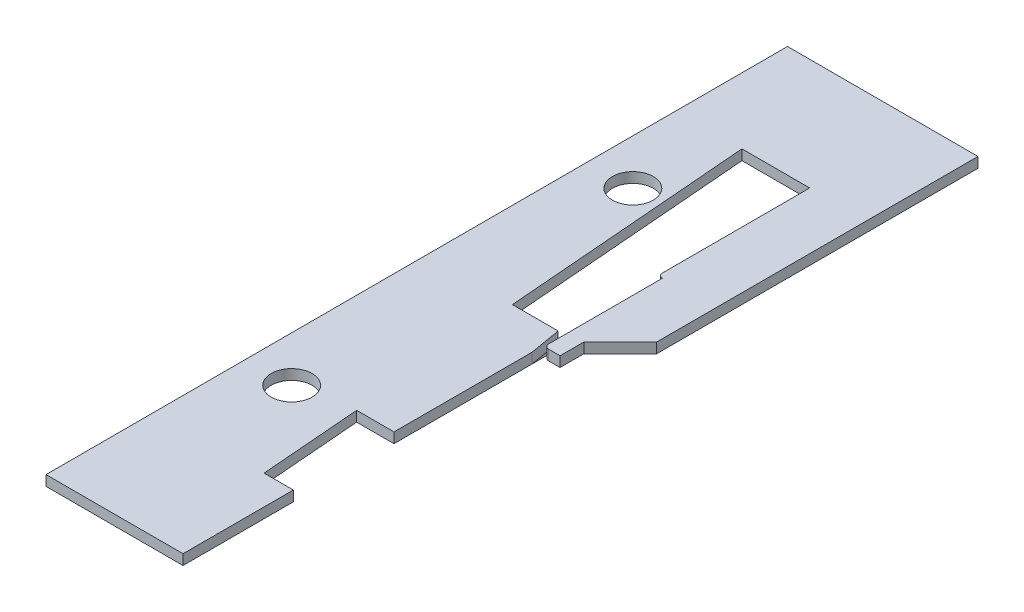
ISO-10303-21;
HEADER;
FILE_DESCRIPTION(('STEP AP214'),'2;1');
FILE_NAME('part.step','',(''),(''),'','','');
FILE_SCHEMA(('AUTOMOTIVE_DESIGN { 1 0 10303 214 1 1 1 1 }'));
ENDSEC;
DATA;
#1=APPLICATION_CONTEXT('core data for automotive mechanical design processes');
#2=APPLICATION_PROTOCOL_DEFINITION('international standard','automotive_design',2000,#1);
#3=PRODUCT_CONTEXT('',#1,'mechanical');
#4=PRODUCT('Part','Part','',(#3));
#5=PRODUCT_RELATED_PRODUCT_CATEGORY('part','',(#4));
#6=PRODUCT_DEFINITION_FORMATION('','',#4);
#7=PRODUCT_DEFINITION_CONTEXT('part definition',#1,'design');
#8=PRODUCT_DEFINITION('design','',#6,#7);
#9=PRODUCT_DEFINITION_SHAPE('','',#8);
#10=(LENGTH_UNIT() NAMED_UNIT(*) SI_UNIT(.MILLI.,.METRE.));
#11=(NAMED_UNIT(*) PLANE_ANGLE_UNIT() SI_UNIT($,.RADIAN.));
#12=(NAMED_UNIT(*) SI_UNIT($,.STERADIAN.) SOLID_ANGLE_UNIT());
#13=UNCERTAINTY_MEASURE_WITH_UNIT(LENGTH_MEASURE(1.E-05),#10,'distance_accuracy_value','');
#14=(GEOMETRIC_REPRESENTATION_CONTEXT(3) GLOBAL_UNCERTAINTY_ASSIGNED_CONTEXT((#13)) GLOBAL_UNIT_ASSIGNED_CONTEXT((#10,
#11,#12)) REPRESENTATION_CONTEXT('',''));
#15=CARTESIAN_POINT('',(0.,0.,0.));
#16=DIRECTION('',(0.,0.,1.));
#17=DIRECTION('',(1.,0.,0.));
#18=AXIS2_PLACEMENT_3D('',#15,#16,#17);
#19=CARTESIAN_POINT('',(42.25,0.9,0.));
#20=DIRECTION('',(1.,0.,0.));
#21=DIRECTION('',(0.,0.,-1.));
#22=AXIS2_PLACEMENT_3D('',#19,#20,#21);
#23=PLANE('',#22);
#24=DIRECTION('',(0.,-1.,0.));
#25=VECTOR('',#24,1.);
#26=CARTESIAN_POINT('',(42.25,0.9,-9.5));
#27=LINE('',#26,#25);
#28=CARTESIAN_POINT('',(42.25,0.9,-9.5));
#29=VERTEX_POINT('',#28);
#30=CARTESIAN_POINT('',(42.25,0.,-9.5));
#31=VERTEX_POINT('',#30);
#32=EDGE_CURVE('E300',#29,#31,#27,.T.);
#33=ORIENTED_EDGE('',*,*,#32,.T.);
#34=DIRECTION('',(0.,0.,1.));
#35=VECTOR('',#34,1.);
#36=CARTESIAN_POINT('',(42.25,0.,-13.5000000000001));
#37=LINE('',#36,#35);
#38=CARTESIAN_POINT('',(42.25,0.,-13.5000000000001));
#39=VERTEX_POINT('',#38);
#40=EDGE_CURVE('E277',#39,#31,#37,.T.);
#41=ORIENTED_EDGE('',*,*,#40,.F.);
#42=DIRECTION('',(0.,1.,0.));
#43=VECTOR('',#42,1.);
#44=CARTESIAN_POINT('',(42.25,-0.4,-13.5000000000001));
#45=LINE('',#44,#43);
#46=CARTESIAN_POINT('',(42.25,-0.4,-13.5000000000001));
#47=VERTEX_POINT('',#46);
#48=EDGE_CURVE('E285',#47,#39,#45,.T.);
#49=ORIENTED_EDGE('',*,*,#48,.F.);
#50=DIRECTION('',(0.,0.,1.));
#51=VECTOR('',#50,1.);
#52=CARTESIAN_POINT('',(42.25,-0.4,-13.5000000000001));
#53=LINE('',#52,#51);
#54=CARTESIAN_POINT('',(42.25,-0.4,0.499999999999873));
#55=VERTEX_POINT('',#54);
#56=EDGE_CURVE('E266',#47,#55,#53,.T.);
#57=ORIENTED_EDGE('',*,*,#56,.T.);
#58=DIRECTION('',(0.,1.,0.));
#59=VECTOR('',#58,1.);
#60=CARTESIAN_POINT('',(42.25,-0.4,0.499999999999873));
#61=LINE('',#60,#59);
#62=CARTESIAN_POINT('',(42.25,0.,0.499999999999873));
#63=VERTEX_POINT('',#62);
#64=EDGE_CURVE('E283',#55,#63,#61,.T.);
#65=ORIENTED_EDGE('',*,*,#64,.T.);
#66=DIRECTION('',(0.,-1.,0.));
#67=VECTOR('',#66,1.);
#68=CARTESIAN_POINT('',(42.25,0.9,0.500000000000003));
#69=LINE('',#68,#67);
#70=CARTESIAN_POINT('',(42.25,0.9,0.500000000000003));
#71=VERTEX_POINT('',#70);
#72=EDGE_CURVE('E11',#71,#63,#69,.T.);
#73=ORIENTED_EDGE('',*,*,#72,.F.);
#74=DIRECTION('',(0.,0.,1.));
#75=VECTOR('',#74,1.);
#76=CARTESIAN_POINT('',(42.25,0.9,0.));
#77=LINE('',#76,#75);
#78=EDGE_CURVE('E487',#29,#71,#77,.T.);
#79=ORIENTED_EDGE('',*,*,#78,.F.);
#80=EDGE_LOOP('',(#33,#41,#49,#57,#65,#73,#79));
#81=FACE_BOUND('',#80,.T.);
#82=ADVANCED_FACE('F35',(#81),#23,.F.);
#83=CARTESIAN_POINT('',(42.65,0.9,0.5));
#84=DIRECTION('',(0.,-1.,0.));
#85=DIRECTION('',(0.,0.,-1.));
#86=AXIS2_PLACEMENT_3D('',#83,#84,#85);
#87=CYLINDRICAL_SURFACE('',#86,0.399999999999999);
#88=CARTESIAN_POINT('',(42.65,0.,0.5));
#89=DIRECTION('',(0.,1.,0.));
#90=DIRECTION('',(0.,0.,1.));
#91=AXIS2_PLACEMENT_3D('',#88,#89,#90);
#92=CIRCLE('',#91,0.399999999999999);
#93=CARTESIAN_POINT('',(42.65,0.,0.9));
#94=VERTEX_POINT('',#93);
#95=EDGE_CURVE('E326',#63,#94,#92,.T.);
#96=ORIENTED_EDGE('',*,*,#95,.T.);
#97=DIRECTION('',(0.,-1.,0.));
#98=VECTOR('',#97,1.);
#99=CARTESIAN_POINT('',(42.65,0.9,0.9));
#100=LINE('',#99,#98);
#101=CARTESIAN_POINT('',(42.65,0.9,0.9));
#102=VERTEX_POINT('',#101);
#103=EDGE_CURVE('E44',#102,#94,#100,.T.);
#104=ORIENTED_EDGE('',*,*,#103,.F.);
#105=CARTESIAN_POINT('',(42.65,0.9,0.5));
#106=DIRECTION('',(0.,1.,0.));
#107=DIRECTION('',(0.,0.,1.));
#108=AXIS2_PLACEMENT_3D('',#105,#106,#107);
#109=CIRCLE('',#108,0.399999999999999);
#110=EDGE_CURVE('E437',#71,#102,#109,.T.);
#111=ORIENTED_EDGE('',*,*,#110,.F.);
#112=ORIENTED_EDGE('',*,*,#72,.T.);
#113=EDGE_LOOP('',(#96,#104,#111,#112));
#114=FACE_BOUND('',#113,.T.);
#115=ADVANCED_FACE('F510',(#114),#87,.T.);
#116=CARTESIAN_POINT('',(0.,0.9,0.900000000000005));
#117=DIRECTION('',(0.,0.,-1.));
#118=DIRECTION('',(-1.,0.,0.));
#119=AXIS2_PLACEMENT_3D('',#116,#117,#118);
#120=PLANE('',#119);
#121=DIRECTION('',(1.,0.,0.));
#122=VECTOR('',#121,1.);
#123=CARTESIAN_POINT('',(0.,0.,0.900000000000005));
#124=LINE('',#123,#122);
#125=CARTESIAN_POINT('',(43.65,0.,0.9));
#126=VERTEX_POINT('',#125);
#127=EDGE_CURVE('E328',#94,#126,#124,.T.);
#128=ORIENTED_EDGE('',*,*,#127,.T.);
#129=DIRECTION('',(0.,-1.,0.));
#130=VECTOR('',#129,1.);
#131=CARTESIAN_POINT('',(43.65,0.9,0.9));
#132=LINE('',#131,#130);
#133=CARTESIAN_POINT('',(43.65,0.9,0.9));
#134=VERTEX_POINT('',#133);
#135=EDGE_CURVE('E409',#134,#126,#132,.T.);
#136=ORIENTED_EDGE('',*,*,#135,.F.);
#137=DIRECTION('',(1.,0.,0.));
#138=VECTOR('',#137,1.);
#139=CARTESIAN_POINT('',(0.,0.9,0.900000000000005));
#140=LINE('',#139,#138);
#141=EDGE_CURVE('E417',#102,#134,#140,.T.);
#142=ORIENTED_EDGE('',*,*,#141,.F.);
#143=ORIENTED_EDGE('',*,*,#103,.T.);
#144=EDGE_LOOP('',(#128,#136,#142,#143));
#145=FACE_BOUND('',#144,.T.);
#146=ADVANCED_FACE('F415',(#145),#120,.F.);
#147=CARTESIAN_POINT('',(43.65,0.9,0.));
#148=DIRECTION('',(1.,0.,0.));
#149=DIRECTION('',(0.,0.,-1.));
#150=AXIS2_PLACEMENT_3D('',#147,#148,#149);
#151=PLANE('',#150);
#152=DIRECTION('',(0.,0.,1.));
#153=VECTOR('',#152,1.);
#154=CARTESIAN_POINT('',(43.65,0.,0.));
#155=LINE('',#154,#153);
#156=CARTESIAN_POINT('',(43.65,0.,-1.20000000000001));
#157=VERTEX_POINT('',#156);
#158=EDGE_CURVE('E331',#157,#126,#155,.T.);
#159=ORIENTED_EDGE('',*,*,#158,.F.);
#160=DIRECTION('',(0.,-1.,0.));
#161=VECTOR('',#160,1.);
#162=CARTESIAN_POINT('',(43.65,0.9,-1.20000000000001));
#163=LINE('',#162,#161);
#164=CARTESIAN_POINT('',(43.65,0.9,-1.20000000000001));
#165=VERTEX_POINT('',#164);
#166=EDGE_CURVE('E407',#165,#157,#163,.T.);
#167=ORIENTED_EDGE('',*,*,#166,.F.);
#168=DIRECTION('',(0.,0.,1.));
#169=VECTOR('',#168,1.);
#170=CARTESIAN_POINT('',(43.65,0.9,0.));
#171=LINE('',#170,#169);
#172=EDGE_CURVE('E430',#165,#134,#171,.T.);
#173=ORIENTED_EDGE('',*,*,#172,.T.);
#174=ORIENTED_EDGE('',*,*,#135,.T.);
#175=EDGE_LOOP('',(#159,#167,#173,#174));
#176=FACE_BOUND('',#175,.T.);
#177=ADVANCED_FACE('F427',(#176),#151,.T.);
#178=CARTESIAN_POINT('',(21.225,0.9,21.225));
#179=DIRECTION('',(0.707106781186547,0.,0.707106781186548));
#180=DIRECTION('',(0.707106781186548,0.,-0.707106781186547));
#181=AXIS2_PLACEMENT_3D('',#178,#179,#180);
#182=PLANE('',#181);
#183=DIRECTION('',(-0.707106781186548,0.,0.707106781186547));
#184=VECTOR('',#183,1.);
#185=CARTESIAN_POINT('',(21.225,0.,21.225));
#186=LINE('',#185,#184);
#187=CARTESIAN_POINT('',(46.85,0.,-4.40000000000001));
#188=VERTEX_POINT('',#187);
#189=EDGE_CURVE('E334',#188,#157,#186,.T.);
#190=ORIENTED_EDGE('',*,*,#189,.F.);
#191=DIRECTION('',(0.,-1.,0.));
#192=VECTOR('',#191,1.);
#193=CARTESIAN_POINT('',(46.85,0.9,-4.40000000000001));
#194=LINE('',#193,#192);
#195=CARTESIAN_POINT('',(46.85,0.9,-4.40000000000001));
#196=VERTEX_POINT('',#195);
#197=EDGE_CURVE('E405',#196,#188,#194,.T.);
#198=ORIENTED_EDGE('',*,*,#197,.F.);
#199=DIRECTION('',(-0.707106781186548,0.,0.707106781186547));
#200=VECTOR('',#199,1.);
#201=CARTESIAN_POINT('',(21.225,0.9,21.225));
#202=LINE('',#201,#200);
#203=EDGE_CURVE('E433',#196,#165,#202,.T.);
#204=ORIENTED_EDGE('',*,*,#203,.T.);
#205=ORIENTED_EDGE('',*,*,#166,.T.);
#206=EDGE_LOOP('',(#190,#198,#204,#205));
#207=FACE_BOUND('',#206,.T.);
#208=ADVANCED_FACE('F579',(#207),#182,.T.);
#209=CARTESIAN_POINT('',(46.85,0.9,0.));
#210=DIRECTION('',(-1.,0.,0.));
#211=DIRECTION('',(0.,0.,1.));
#212=AXIS2_PLACEMENT_3D('',#209,#210,#211);
#213=PLANE('',#212);
#214=DIRECTION('',(0.,0.,-1.));
#215=VECTOR('',#214,1.);
#216=CARTESIAN_POINT('',(46.85,0.,0.));
#217=LINE('',#216,#215);
#218=CARTESIAN_POINT('',(46.85,0.,-32.65));
#219=VERTEX_POINT('',#218);
#220=EDGE_CURVE('E337',#188,#219,#217,.T.);
#221=ORIENTED_EDGE('',*,*,#220,.T.);
#222=DIRECTION('',(0.,-1.,0.));
#223=VECTOR('',#222,1.);
#224=CARTESIAN_POINT('',(46.85,0.9,-32.65));
#225=LINE('',#224,#223);
#226=CARTESIAN_POINT('',(46.85,0.9,-32.65));
#227=VERTEX_POINT('',#226);
#228=EDGE_CURVE('E403',#227,#219,#225,.T.);
#229=ORIENTED_EDGE('',*,*,#228,.F.);
#230=DIRECTION('',(0.,0.,-1.));
#231=VECTOR('',#230,1.);
#232=CARTESIAN_POINT('',(46.85,0.9,0.));
#233=LINE('',#232,#231);
#234=EDGE_CURVE('E435',#196,#227,#233,.T.);
#235=ORIENTED_EDGE('',*,*,#234,.F.);
#236=ORIENTED_EDGE('',*,*,#197,.T.);
#237=EDGE_LOOP('',(#221,#229,#235,#236));
#238=FACE_BOUND('',#237,.T.);
#239=ADVANCED_FACE('F575',(#238),#213,.F.);
#240=CARTESIAN_POINT('',(0.,0.9,-32.65));
#241=DIRECTION('',(0.,0.,-1.));
#242=DIRECTION('',(-1.,0.,0.));
#243=AXIS2_PLACEMENT_3D('',#240,#241,#242);
#244=PLANE('',#243);
#245=DIRECTION('',(1.,0.,0.));
#246=VECTOR('',#245,1.);
#247=CARTESIAN_POINT('',(0.,0.,-32.65));
#248=LINE('',#247,#246);
#249=CARTESIAN_POINT('',(30.1,0.,-32.65));
#250=VERTEX_POINT('',#249);
#251=EDGE_CURVE('E340',#250,#219,#248,.T.);
#252=ORIENTED_EDGE('',*,*,#251,.F.);
#253=DIRECTION('',(0.,-1.,0.));
#254=VECTOR('',#253,1.);
#255=CARTESIAN_POINT('',(30.1,0.9,-32.65));
#256=LINE('',#255,#254);
#257=CARTESIAN_POINT('',(30.1,0.9,-32.65));
#258=VERTEX_POINT('',#257);
#259=EDGE_CURVE('E401',#258,#250,#256,.T.);
#260=ORIENTED_EDGE('',*,*,#259,.F.);
#261=DIRECTION('',(1.,0.,0.));
#262=VECTOR('',#261,1.);
#263=CARTESIAN_POINT('',(0.,0.9,-32.65));
#264=LINE('',#263,#262);
#265=EDGE_CURVE('E442',#258,#227,#264,.T.);
#266=ORIENTED_EDGE('',*,*,#265,.T.);
#267=ORIENTED_EDGE('',*,*,#228,.T.);
#268=EDGE_LOOP('',(#252,#260,#266,#267));
#269=FACE_BOUND('',#268,.T.);
#270=ADVANCED_FACE('F571',(#269),#244,.T.);
#271=CARTESIAN_POINT('',(30.1,0.9,0.));
#272=DIRECTION('',(-1.,0.,0.));
#273=DIRECTION('',(0.,0.,1.));
#274=AXIS2_PLACEMENT_3D('',#271,#272,#273);
#275=PLANE('',#274);
#276=DIRECTION('',(0.,0.,-1.));
#277=VECTOR('',#276,1.);
#278=CARTESIAN_POINT('',(30.1,0.,0.));
#279=LINE('',#278,#277);
#280=CARTESIAN_POINT('',(30.1,0.,32.55));
#281=VERTEX_POINT('',#280);
#282=EDGE_CURVE('E343',#281,#250,#279,.T.);
#283=ORIENTED_EDGE('',*,*,#282,.F.);
#284=DIRECTION('',(0.,-1.,0.));
#285=VECTOR('',#284,1.);
#286=CARTESIAN_POINT('',(30.1,0.9,32.55));
#287=LINE('',#286,#285);
#288=CARTESIAN_POINT('',(30.1,0.9,32.55));
#289=VERTEX_POINT('',#288);
#290=EDGE_CURVE('E399',#289,#281,#287,.T.);
#291=ORIENTED_EDGE('',*,*,#290,.F.);
#292=DIRECTION('',(0.,0.,-1.));
#293=VECTOR('',#292,1.);
#294=CARTESIAN_POINT('',(30.1,0.9,0.));
#295=LINE('',#294,#293);
#296=EDGE_CURVE('E445',#289,#258,#295,.T.);
#297=ORIENTED_EDGE('',*,*,#296,.T.);
#298=ORIENTED_EDGE('',*,*,#259,.T.);
#299=EDGE_LOOP('',(#283,#291,#297,#298));
#300=FACE_BOUND('',#299,.T.);
#301=ADVANCED_FACE('F567',(#300),#275,.T.);
#302=CARTESIAN_POINT('',(0.,0.9,32.55));
#303=DIRECTION('',(0.,0.,-1.));
#304=DIRECTION('',(-1.,0.,0.));
#305=AXIS2_PLACEMENT_3D('',#302,#303,#304);
#306=PLANE('',#305);
#307=DIRECTION('',(1.,0.,0.));
#308=VECTOR('',#307,1.);
#309=CARTESIAN_POINT('',(0.,0.,32.55));
#310=LINE('',#309,#308);
#311=CARTESIAN_POINT('',(42.15,0.,32.55));
#312=VERTEX_POINT('',#311);
#313=EDGE_CURVE('E346',#281,#312,#310,.T.);
#314=ORIENTED_EDGE('',*,*,#313,.T.);
#315=DIRECTION('',(0.,-1.,0.));
#316=VECTOR('',#315,1.);
#317=CARTESIAN_POINT('',(42.15,0.9,32.55));
#318=LINE('',#317,#316);
#319=CARTESIAN_POINT('',(42.15,0.9,32.55));
#320=VERTEX_POINT('',#319);
#321=EDGE_CURVE('E397',#320,#312,#318,.T.);
#322=ORIENTED_EDGE('',*,*,#321,.F.);
#323=DIRECTION('',(1.,0.,0.));
#324=VECTOR('',#323,1.);
#325=CARTESIAN_POINT('',(0.,0.9,32.55));
#326=LINE('',#325,#324);
#327=EDGE_CURVE('E448',#289,#320,#326,.T.);
#328=ORIENTED_EDGE('',*,*,#327,.F.);
#329=ORIENTED_EDGE('',*,*,#290,.T.);
#330=EDGE_LOOP('',(#314,#322,#328,#329));
#331=FACE_BOUND('',#330,.T.);
#332=ADVANCED_FACE('F563',(#331),#306,.F.);
#333=CARTESIAN_POINT('',(42.15,0.9,0.));
#334=DIRECTION('',(1.,0.,0.));
#335=DIRECTION('',(0.,0.,-1.));
#336=AXIS2_PLACEMENT_3D('',#333,#334,#335);
#337=PLANE('',#336);
#338=DIRECTION('',(0.,0.,1.));
#339=VECTOR('',#338,1.);
#340=CARTESIAN_POINT('',(42.15,0.,0.));
#341=LINE('',#340,#339);
#342=CARTESIAN_POINT('',(42.15,0.,22.8500000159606));
#343=VERTEX_POINT('',#342);
#344=EDGE_CURVE('E349',#343,#312,#341,.T.);
#345=ORIENTED_EDGE('',*,*,#344,.F.);
#346=DIRECTION('',(0.,-1.,0.));
#347=VECTOR('',#346,1.);
#348=CARTESIAN_POINT('',(42.15,0.9,22.8500000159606));
#349=LINE('',#348,#347);
#350=CARTESIAN_POINT('',(42.15,0.9,22.8500000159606));
#351=VERTEX_POINT('',#350);
#352=EDGE_CURVE('E395',#351,#343,#349,.T.);
#353=ORIENTED_EDGE('',*,*,#352,.F.);
#354=DIRECTION('',(0.,0.,1.));
#355=VECTOR('',#354,1.);
#356=CARTESIAN_POINT('',(42.15,0.9,0.));
#357=LINE('',#356,#355);
#358=EDGE_CURVE('E450',#351,#320,#357,.T.);
#359=ORIENTED_EDGE('',*,*,#358,.T.);
#360=ORIENTED_EDGE('',*,*,#321,.T.);
#361=EDGE_LOOP('',(#345,#353,#359,#360));
#362=FACE_BOUND('',#361,.T.);
#363=ADVANCED_FACE('F559',(#362),#337,.T.);
#364=CARTESIAN_POINT('',(0.,0.9,22.8500000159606));
#365=DIRECTION('',(0.,0.,1.));
#366=DIRECTION('',(1.,0.,0.));
#367=AXIS2_PLACEMENT_3D('',#364,#365,#366);
#368=PLANE('',#367);
#369=DIRECTION('',(-1.,0.,0.));
#370=VECTOR('',#369,1.);
#371=CARTESIAN_POINT('',(0.,0.,22.8500000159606));
#372=LINE('',#371,#370);
#373=CARTESIAN_POINT('',(39.5765076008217,0.,22.8500000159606));
#374=VERTEX_POINT('',#373);
#375=EDGE_CURVE('E352',#343,#374,#372,.T.);
#376=ORIENTED_EDGE('',*,*,#375,.T.);
#377=DIRECTION('',(0.,-1.,0.));
#378=VECTOR('',#377,1.);
#379=CARTESIAN_POINT('',(39.5765076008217,0.9,22.8500000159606));
#380=LINE('',#379,#378);
#381=CARTESIAN_POINT('',(39.5765076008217,0.9,22.8500000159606));
#382=VERTEX_POINT('',#381);
#383=EDGE_CURVE('E393',#382,#374,#380,.T.);
#384=ORIENTED_EDGE('',*,*,#383,.F.);
#385=DIRECTION('',(-1.,0.,0.));
#386=VECTOR('',#385,1.);
#387=CARTESIAN_POINT('',(0.,0.9,22.8500000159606));
#388=LINE('',#387,#386);
#389=EDGE_CURVE('E453',#351,#382,#388,.T.);
#390=ORIENTED_EDGE('',*,*,#389,.F.);
#391=ORIENTED_EDGE('',*,*,#352,.T.);
#392=EDGE_LOOP('',(#376,#384,#390,#391));
#393=FACE_BOUND('',#392,.T.);
#394=ADVANCED_FACE('F555',(#393),#368,.F.);
#395=CARTESIAN_POINT('',(37.4903141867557,0.9,-3.02292966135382));
#396=DIRECTION('',(0.996764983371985,0.,-0.0803714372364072));
#397=DIRECTION('',(-0.0803714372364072,0.,-0.996764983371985));
#398=AXIS2_PLACEMENT_3D('',#395,#396,#397);
#399=PLANE('',#398);
#400=DIRECTION('',(0.0803714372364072,0.,0.996764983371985));
#401=VECTOR('',#400,1.);
#402=CARTESIAN_POINT('',(37.4903141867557,0.,-3.02292966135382));
#403=LINE('',#402,#401);
#404=CARTESIAN_POINT('',(38.8629118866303,0.,14.0000000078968));
#405=VERTEX_POINT('',#404);
#406=EDGE_CURVE('E355',#405,#374,#403,.T.);
#407=ORIENTED_EDGE('',*,*,#406,.F.);
#408=DIRECTION('',(0.,-1.,0.));
#409=VECTOR('',#408,1.);
#410=CARTESIAN_POINT('',(38.8629118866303,0.9,14.0000000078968));
#411=LINE('',#410,#409);
#412=CARTESIAN_POINT('',(38.8629118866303,0.9,14.0000000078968));
#413=VERTEX_POINT('',#412);
#414=EDGE_CURVE('E391',#413,#405,#411,.T.);
#415=ORIENTED_EDGE('',*,*,#414,.F.);
#416=DIRECTION('',(0.0803714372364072,0.,0.996764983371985));
#417=VECTOR('',#416,1.);
#418=CARTESIAN_POINT('',(37.4903141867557,0.9,-3.02292966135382));
#419=LINE('',#418,#417);
#420=EDGE_CURVE('E455',#413,#382,#419,.T.);
#421=ORIENTED_EDGE('',*,*,#420,.T.);
#422=ORIENTED_EDGE('',*,*,#383,.T.);
#423=EDGE_LOOP('',(#407,#415,#421,#422));
#424=FACE_BOUND('',#423,.T.);
#425=ADVANCED_FACE('F551',(#424),#399,.T.);
#426=CARTESIAN_POINT('',(0.,0.9,14.0000000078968));
#427=DIRECTION('',(0.,0.,-1.));
#428=DIRECTION('',(-1.,0.,0.));
#429=AXIS2_PLACEMENT_3D('',#426,#427,#428);
#430=PLANE('',#429);
#431=DIRECTION('',(1.,0.,0.));
#432=VECTOR('',#431,1.);
#433=CARTESIAN_POINT('',(0.,0.,14.0000000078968));
#434=LINE('',#433,#432);
#435=CARTESIAN_POINT('',(42.15,0.,14.0000000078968));
#436=VERTEX_POINT('',#435);
#437=EDGE_CURVE('E358',#405,#436,#434,.T.);
#438=ORIENTED_EDGE('',*,*,#437,.T.);
#439=DIRECTION('',(0.,-1.,0.));
#440=VECTOR('',#439,1.);
#441=CARTESIAN_POINT('',(42.15,0.9,14.0000000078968));
#442=LINE('',#441,#440);
#443=CARTESIAN_POINT('',(42.15,0.9,14.0000000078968));
#444=VERTEX_POINT('',#443);
#445=EDGE_CURVE('E389',#444,#436,#442,.T.);
#446=ORIENTED_EDGE('',*,*,#445,.F.);
#447=DIRECTION('',(1.,0.,0.));
#448=VECTOR('',#447,1.);
#449=CARTESIAN_POINT('',(0.,0.9,14.0000000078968));
#450=LINE('',#449,#448);
#451=EDGE_CURVE('E458',#413,#444,#450,.T.);
#452=ORIENTED_EDGE('',*,*,#451,.F.);
#453=ORIENTED_EDGE('',*,*,#414,.T.);
#454=EDGE_LOOP('',(#438,#446,#452,#453));
#455=FACE_BOUND('',#454,.T.);
#456=ADVANCED_FACE('F547',(#455),#430,.F.);
#457=CARTESIAN_POINT('',(42.15,0.9,0.));
#458=DIRECTION('',(1.,0.,0.));
#459=DIRECTION('',(0.,0.,-1.));
#460=AXIS2_PLACEMENT_3D('',#457,#458,#459);
#461=PLANE('',#460);
#462=DIRECTION('',(0.,0.,1.));
#463=VECTOR('',#462,1.);
#464=CARTESIAN_POINT('',(42.15,0.,0.));
#465=LINE('',#464,#463);
#466=CARTESIAN_POINT('',(42.15,0.,1.8733333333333));
#467=VERTEX_POINT('',#466);
#468=EDGE_CURVE('E361',#467,#436,#465,.T.);
#469=ORIENTED_EDGE('',*,*,#468,.F.);
#470=DIRECTION('',(0.,-1.,0.));
#471=VECTOR('',#470,1.);
#472=CARTESIAN_POINT('',(42.15,0.9,1.8733333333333));
#473=LINE('',#472,#471);
#474=CARTESIAN_POINT('',(42.15,0.9,1.8733333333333));
#475=VERTEX_POINT('',#474);
#476=EDGE_CURVE('E386',#475,#467,#473,.T.);
#477=ORIENTED_EDGE('',*,*,#476,.F.);
#478=DIRECTION('',(0.,0.,1.));
#479=VECTOR('',#478,1.);
#480=CARTESIAN_POINT('',(42.15,0.9,0.));
#481=LINE('',#480,#479);
#482=EDGE_CURVE('E460',#475,#444,#481,.T.);
#483=ORIENTED_EDGE('',*,*,#482,.T.);
#484=ORIENTED_EDGE('',*,*,#445,.T.);
#485=EDGE_LOOP('',(#469,#477,#483,#484));
#486=FACE_BOUND('',#485,.T.);
#487=ADVANCED_FACE('F543',(#486),#461,.T.);
#488=CARTESIAN_POINT('',(40.6787687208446,0.9,-6.85597225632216));
#489=DIRECTION('',(0.986092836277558,0.,-0.166195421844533));
#490=DIRECTION('',(-0.166195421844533,0.,-0.986092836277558));
#491=AXIS2_PLACEMENT_3D('',#488,#489,#490);
#492=PLANE('',#491);
#493=DIRECTION('',(0.166195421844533,0.,0.986092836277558));
#494=VECTOR('',#493,1.);
#495=CARTESIAN_POINT('',(40.6787687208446,0.,-6.85597225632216));
#496=LINE('',#495,#494);
#497=CARTESIAN_POINT('',(41.6825842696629,0.,-0.900000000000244));
#498=VERTEX_POINT('',#497);
#499=CARTESIAN_POINT('',(41.75,0.,-0.500000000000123));
#500=VERTEX_POINT('',#499);
#501=EDGE_CURVE('E365',#498,#500,#496,.T.);
#502=ORIENTED_EDGE('',*,*,#501,.F.);
#503=DIRECTION('',(0.,-1.,0.));
#504=VECTOR('',#503,1.);
#505=CARTESIAN_POINT('',(41.6825842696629,0.9,-0.900000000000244));
#506=LINE('',#505,#504);
#507=CARTESIAN_POINT('',(41.6825842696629,0.9,-0.900000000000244));
#508=VERTEX_POINT('',#507);
#509=EDGE_CURVE('E384',#508,#498,#506,.T.);
#510=ORIENTED_EDGE('',*,*,#509,.F.);
#511=DIRECTION('',(0.166195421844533,0.,0.986092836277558));
#512=VECTOR('',#511,1.);
#513=CARTESIAN_POINT('',(40.6787687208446,0.9,-6.85597225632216));
#514=LINE('',#513,#512);
#515=EDGE_CURVE('E463',#508,#475,#514,.T.);
#516=ORIENTED_EDGE('',*,*,#515,.T.);
#517=ORIENTED_EDGE('',*,*,#476,.T.);
#518=EDGE_CURVE('E364',#500,#467,#496,.T.);
#519=ORIENTED_EDGE('',*,*,#518,.F.);
#520=EDGE_LOOP('',(#502,#510,#516,#517,#519));
#521=FACE_BOUND('',#520,.T.);
#522=ADVANCED_FACE('F539',(#521),#492,.T.);
#523=CARTESIAN_POINT('',(0.,0.9,-0.900000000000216));
#524=DIRECTION('',(0.,0.,-1.));
#525=DIRECTION('',(-1.,0.,0.));
#526=AXIS2_PLACEMENT_3D('',#523,#524,#525);
#527=PLANE('',#526);
#528=DIRECTION('',(1.,0.,0.));
#529=VECTOR('',#528,1.);
#530=CARTESIAN_POINT('',(0.,0.,-0.900000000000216));
#531=LINE('',#530,#529);
#532=CARTESIAN_POINT('',(37.6614908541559,0.,-0.900000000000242));
#533=VERTEX_POINT('',#532);
#534=EDGE_CURVE('E368',#533,#498,#531,.T.);
#535=ORIENTED_EDGE('',*,*,#534,.F.);
#536=DIRECTION('',(0.,-1.,0.));
#537=VECTOR('',#536,1.);
#538=CARTESIAN_POINT('',(37.6614908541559,0.9,-0.900000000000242));
#539=LINE('',#538,#537);
#540=CARTESIAN_POINT('',(37.6614908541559,0.9,-0.900000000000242));
#541=VERTEX_POINT('',#540);
#542=EDGE_CURVE('E382',#541,#533,#539,.T.);
#543=ORIENTED_EDGE('',*,*,#542,.F.);
#544=DIRECTION('',(1.,0.,0.));
#545=VECTOR('',#544,1.);
#546=CARTESIAN_POINT('',(0.,0.9,-0.900000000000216));
#547=LINE('',#546,#545);
#548=EDGE_CURVE('E466',#541,#508,#547,.T.);
#549=ORIENTED_EDGE('',*,*,#548,.T.);
#550=ORIENTED_EDGE('',*,*,#509,.T.);
#551=EDGE_LOOP('',(#535,#543,#549,#550));
#552=FACE_BOUND('',#551,.T.);
#553=ADVANCED_FACE('F535',(#552),#527,.T.);
#554=CARTESIAN_POINT('',(37.4903141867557,0.9,-3.02292966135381));
#555=DIRECTION('',(0.996764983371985,0.,-0.080371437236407));
#556=DIRECTION('',(-0.080371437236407,0.,-0.996764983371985));
#557=AXIS2_PLACEMENT_3D('',#554,#555,#556);
#558=PLANE('',#557);
#559=DIRECTION('',(0.080371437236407,0.,0.996764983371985));
#560=VECTOR('',#559,1.);
#561=CARTESIAN_POINT('',(37.4903141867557,0.,-3.02292966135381));
#562=LINE('',#561,#560);
#563=CARTESIAN_POINT('',(35.8916122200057,0.,-22.85));
#564=VERTEX_POINT('',#563);
#565=EDGE_CURVE('E371',#564,#533,#562,.T.);
#566=ORIENTED_EDGE('',*,*,#565,.F.);
#567=DIRECTION('',(0.,-1.,0.));
#568=VECTOR('',#567,1.);
#569=CARTESIAN_POINT('',(35.8916122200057,0.9,-22.85));
#570=LINE('',#569,#568);
#571=CARTESIAN_POINT('',(35.8916122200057,0.9,-22.85));
#572=VERTEX_POINT('',#571);
#573=EDGE_CURVE('E380',#572,#564,#570,.T.);
#574=ORIENTED_EDGE('',*,*,#573,.F.);
#575=DIRECTION('',(0.080371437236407,0.,0.996764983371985));
#576=VECTOR('',#575,1.);
#577=CARTESIAN_POINT('',(37.4903141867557,0.9,-3.02292966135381));
#578=LINE('',#577,#576);
#579=EDGE_CURVE('E469',#572,#541,#578,.T.);
#580=ORIENTED_EDGE('',*,*,#579,.T.);
#581=ORIENTED_EDGE('',*,*,#542,.T.);
#582=EDGE_LOOP('',(#566,#574,#580,#581));
#583=FACE_BOUND('',#582,.T.);
#584=ADVANCED_FACE('F530',(#583),#558,.T.);
#585=CARTESIAN_POINT('',(0.,0.9,-22.85));
#586=DIRECTION('',(0.,0.,1.));
#587=DIRECTION('',(1.,0.,0.));
#588=AXIS2_PLACEMENT_3D('',#585,#586,#587);
#589=PLANE('',#588);
#590=DIRECTION('',(-1.,0.,0.));
#591=VECTOR('',#590,1.);
#592=CARTESIAN_POINT('',(0.,0.,-22.85));
#593=LINE('',#592,#591);
#594=CARTESIAN_POINT('',(41.85,0.,-22.85));
#595=VERTEX_POINT('',#594);
#596=EDGE_CURVE('E374',#595,#564,#593,.T.);
#597=ORIENTED_EDGE('',*,*,#596,.F.);
#598=DIRECTION('',(0.,-1.,0.));
#599=VECTOR('',#598,1.);
#600=CARTESIAN_POINT('',(41.85,0.9,-22.85));
#601=LINE('',#600,#599);
#602=CARTESIAN_POINT('',(41.85,0.9,-22.85));
#603=VERTEX_POINT('',#602);
#604=EDGE_CURVE('E308',#603,#595,#601,.T.);
#605=ORIENTED_EDGE('',*,*,#604,.F.);
#606=DIRECTION('',(-1.,0.,0.));
#607=VECTOR('',#606,1.);
#608=CARTESIAN_POINT('',(0.,0.9,-22.85));
#609=LINE('',#608,#607);
#610=EDGE_CURVE('E317',#603,#572,#609,.T.);
#611=ORIENTED_EDGE('',*,*,#610,.T.);
#612=ORIENTED_EDGE('',*,*,#573,.T.);
#613=EDGE_LOOP('',(#597,#605,#611,#612));
#614=FACE_BOUND('',#613,.T.);
#615=ADVANCED_FACE('F475',(#614),#589,.T.);
#616=CARTESIAN_POINT('',(41.85,0.9,0.));
#617=DIRECTION('',(-1.,0.,0.));
#618=DIRECTION('',(0.,0.,1.));
#619=AXIS2_PLACEMENT_3D('',#616,#617,#618);
#620=PLANE('',#619);
#621=DIRECTION('',(0.,0.,-1.));
#622=VECTOR('',#621,1.);
#623=CARTESIAN_POINT('',(41.85,0.,0.));
#624=LINE('',#623,#622);
#625=CARTESIAN_POINT('',(41.85,0.,-9.9));
#626=VERTEX_POINT('',#625);
#627=EDGE_CURVE('E298',#626,#595,#624,.T.);
#628=ORIENTED_EDGE('',*,*,#627,.F.);
#629=DIRECTION('',(0.,-1.,0.));
#630=VECTOR('',#629,1.);
#631=CARTESIAN_POINT('',(41.85,0.9,-9.9));
#632=LINE('',#631,#630);
#633=CARTESIAN_POINT('',(41.85,0.9,-9.9));
#634=VERTEX_POINT('',#633);
#635=EDGE_CURVE('E302',#634,#626,#632,.T.);
#636=ORIENTED_EDGE('',*,*,#635,.F.);
#637=DIRECTION('',(0.,0.,-1.));
#638=VECTOR('',#637,1.);
#639=CARTESIAN_POINT('',(41.85,0.9,0.));
#640=LINE('',#639,#638);
#641=EDGE_CURVE('E310',#634,#603,#640,.T.);
#642=ORIENTED_EDGE('',*,*,#641,.T.);
#643=ORIENTED_EDGE('',*,*,#604,.T.);
#644=EDGE_LOOP('',(#628,#636,#642,#643));
#645=FACE_BOUND('',#644,.T.);
#646=ADVANCED_FACE('F482',(#645),#620,.T.);
#647=CARTESIAN_POINT('',(34.1,0.9,14.95));
#648=DIRECTION('',(0.,-1.,0.));
#649=DIRECTION('',(0.,0.,-1.));
#650=AXIS2_PLACEMENT_3D('',#647,#648,#649);
#651=CYLINDRICAL_SURFACE('',#650,1.8);
#652=CARTESIAN_POINT('',(34.1,0.9,14.95));
#653=DIRECTION('',(0.,1.,0.));
#654=DIRECTION('',(0.,0.,1.));
#655=AXIS2_PLACEMENT_3D('',#652,#653,#654);
#656=CIRCLE('',#655,1.8);
#657=CARTESIAN_POINT('',(34.1,0.9,16.75));
#658=VERTEX_POINT('',#657);
#659=EDGE_CURVE('E488',#658,#658,#656,.T.);
#660=ORIENTED_EDGE('',*,*,#659,.T.);
#661=EDGE_LOOP('',(#660));
#662=FACE_BOUND('',#661,.T.);
#663=CARTESIAN_POINT('',(34.1,0.,14.95));
#664=DIRECTION('',(0.,1.,0.));
#665=DIRECTION('',(0.,0.,1.));
#666=AXIS2_PLACEMENT_3D('',#663,#664,#665);
#667=CIRCLE('',#666,1.8);
#668=CARTESIAN_POINT('',(34.1,0.,16.75));
#669=VERTEX_POINT('',#668);
#670=EDGE_CURVE('E323',#669,#669,#667,.T.);
#671=ORIENTED_EDGE('',*,*,#670,.F.);
#672=EDGE_LOOP('',(#671));
#673=FACE_BOUND('',#672,.T.);
#674=ADVANCED_FACE('F517',(#662,#673),#651,.F.);
#675=CARTESIAN_POINT('',(34.1,0.9,-15.05));
#676=DIRECTION('',(0.,-1.,0.));
#677=DIRECTION('',(0.,0.,-1.));
#678=AXIS2_PLACEMENT_3D('',#675,#676,#677);
#679=CYLINDRICAL_SURFACE('',#678,1.8);
#680=CARTESIAN_POINT('',(34.1,0.9,-15.05));
#681=DIRECTION('',(0.,1.,0.));
#682=DIRECTION('',(0.,0.,1.));
#683=AXIS2_PLACEMENT_3D('',#680,#681,#682);
#684=CIRCLE('',#683,1.8);
#685=CARTESIAN_POINT('',(34.1,0.9,-13.25));
#686=VERTEX_POINT('',#685);
#687=EDGE_CURVE('E290',#686,#686,#684,.T.);
#688=ORIENTED_EDGE('',*,*,#687,.T.);
#689=EDGE_LOOP('',(#688));
#690=FACE_BOUND('',#689,.T.);
#691=CARTESIAN_POINT('',(34.1,0.,-15.05));
#692=DIRECTION('',(0.,1.,0.));
#693=DIRECTION('',(0.,0.,1.));
#694=AXIS2_PLACEMENT_3D('',#691,#692,#693);
#695=CIRCLE('',#694,1.8);
#696=CARTESIAN_POINT('',(34.1,0.,-13.25));
#697=VERTEX_POINT('',#696);
#698=EDGE_CURVE('E282',#697,#697,#695,.T.);
#699=ORIENTED_EDGE('',*,*,#698,.F.);
#700=EDGE_LOOP('',(#699));
#701=FACE_BOUND('',#700,.T.);
#702=ADVANCED_FACE('F37',(#690,#701),#679,.F.);
#703=CARTESIAN_POINT('',(42.25,0.9,-9.89999999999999));
#704=DIRECTION('',(0.,-1.,0.));
#705=DIRECTION('',(0.,0.,-1.));
#706=AXIS2_PLACEMENT_3D('',#703,#704,#705);
#707=CYLINDRICAL_SURFACE('',#706,0.399999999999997);
#708=CARTESIAN_POINT('',(42.25,0.,-9.89999999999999));
#709=DIRECTION('',(0.,1.,0.));
#710=DIRECTION('',(0.,0.,1.));
#711=AXIS2_PLACEMENT_3D('',#708,#709,#710);
#712=CIRCLE('',#711,0.399999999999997);
#713=EDGE_CURVE('E295',#626,#31,#712,.T.);
#714=ORIENTED_EDGE('',*,*,#713,.T.);
#715=ORIENTED_EDGE('',*,*,#32,.F.);
#716=CARTESIAN_POINT('',(42.25,0.9,-9.89999999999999));
#717=DIRECTION('',(0.,1.,0.));
#718=DIRECTION('',(0.,0.,1.));
#719=AXIS2_PLACEMENT_3D('',#716,#717,#718);
#720=CIRCLE('',#719,0.399999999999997);
#721=EDGE_CURVE('E303',#634,#29,#720,.T.);
#722=ORIENTED_EDGE('',*,*,#721,.F.);
#723=ORIENTED_EDGE('',*,*,#635,.T.);
#724=EDGE_LOOP('',(#714,#715,#722,#723));
#725=FACE_BOUND('',#724,.T.);
#726=ADVANCED_FACE('F485',(#725),#707,.T.);
#727=CARTESIAN_POINT('',(0.,0.9,0.));
#728=DIRECTION('',(0.,1.,0.));
#729=DIRECTION('',(0.,0.,1.));
#730=AXIS2_PLACEMENT_3D('',#727,#728,#729);
#731=PLANE('',#730);
#732=ORIENTED_EDGE('',*,*,#687,.F.);
#733=EDGE_LOOP('',(#732));
#734=FACE_BOUND('',#733,.T.);
#735=ORIENTED_EDGE('',*,*,#659,.F.);
#736=EDGE_LOOP('',(#735));
#737=FACE_BOUND('',#736,.T.);
#738=ORIENTED_EDGE('',*,*,#78,.T.);
#739=ORIENTED_EDGE('',*,*,#110,.T.);
#740=ORIENTED_EDGE('',*,*,#141,.T.);
#741=ORIENTED_EDGE('',*,*,#172,.F.);
#742=ORIENTED_EDGE('',*,*,#203,.F.);
#743=ORIENTED_EDGE('',*,*,#234,.T.);
#744=ORIENTED_EDGE('',*,*,#265,.F.);
#745=ORIENTED_EDGE('',*,*,#296,.F.);
#746=ORIENTED_EDGE('',*,*,#327,.T.);
#747=ORIENTED_EDGE('',*,*,#358,.F.);
#748=ORIENTED_EDGE('',*,*,#389,.T.);
#749=ORIENTED_EDGE('',*,*,#420,.F.);
#750=ORIENTED_EDGE('',*,*,#451,.T.);
#751=ORIENTED_EDGE('',*,*,#482,.F.);
#752=ORIENTED_EDGE('',*,*,#515,.F.);
#753=ORIENTED_EDGE('',*,*,#548,.F.);
#754=ORIENTED_EDGE('',*,*,#579,.F.);
#755=ORIENTED_EDGE('',*,*,#610,.F.);
#756=ORIENTED_EDGE('',*,*,#641,.F.);
#757=ORIENTED_EDGE('',*,*,#721,.T.);
#758=EDGE_LOOP('',(#738,#739,#740,#741,#742,#743,#744,#745,#746,#747,#748,#749,#750,#751,#752,
#753,#754,#755,#756,#757));
#759=FACE_BOUND('',#758,.T.);
#760=ADVANCED_FACE('F478',(#734,#737,#759),#731,.T.);
#761=CARTESIAN_POINT('',(0.,0.,0.));
#762=DIRECTION('',(0.,1.,0.));
#763=DIRECTION('',(0.,0.,1.));
#764=AXIS2_PLACEMENT_3D('',#761,#762,#763);
#765=PLANE('',#764);
#766=DIRECTION('',(-1.,0.,0.));
#767=VECTOR('',#766,1.);
#768=CARTESIAN_POINT('',(40.7499999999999,0.,-0.500000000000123));
#769=LINE('',#768,#767);
#770=CARTESIAN_POINT('',(40.7499999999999,0.,-0.500000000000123));
#771=VERTEX_POINT('',#770);
#772=EDGE_CURVE('E244',#500,#771,#769,.T.);
#773=ORIENTED_EDGE('',*,*,#772,.T.);
#774=DIRECTION('',(0.,0.,1.));
#775=VECTOR('',#774,1.);
#776=CARTESIAN_POINT('',(40.7499999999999,0.,-0.500000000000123));
#777=LINE('',#776,#775);
#778=CARTESIAN_POINT('',(40.7499999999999,0.,13.4999999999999));
#779=VERTEX_POINT('',#778);
#780=EDGE_CURVE('E251',#771,#779,#777,.T.);
#781=ORIENTED_EDGE('',*,*,#780,.T.);
#782=DIRECTION('',(1.,0.,0.));
#783=VECTOR('',#782,1.);
#784=CARTESIAN_POINT('',(40.7499999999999,0.,13.4999999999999));
#785=LINE('',#784,#783);
#786=CARTESIAN_POINT('',(41.75,0.,13.4999999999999));
#787=VERTEX_POINT('',#786);
#788=EDGE_CURVE('E224',#779,#787,#785,.T.);
#789=ORIENTED_EDGE('',*,*,#788,.T.);
#790=DIRECTION('',(0.,0.,-1.));
#791=VECTOR('',#790,1.);
#792=CARTESIAN_POINT('',(41.75,0.,-0.500000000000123));
#793=LINE('',#792,#791);
#794=EDGE_CURVE('E52',#787,#500,#793,.T.);
#795=ORIENTED_EDGE('',*,*,#794,.T.);
#796=ORIENTED_EDGE('',*,*,#518,.T.);
#797=ORIENTED_EDGE('',*,*,#468,.T.);
#798=ORIENTED_EDGE('',*,*,#437,.F.);
#799=ORIENTED_EDGE('',*,*,#406,.T.);
#800=ORIENTED_EDGE('',*,*,#375,.F.);
#801=ORIENTED_EDGE('',*,*,#344,.T.);
#802=ORIENTED_EDGE('',*,*,#313,.F.);
#803=ORIENTED_EDGE('',*,*,#282,.T.);
#804=ORIENTED_EDGE('',*,*,#251,.T.);
#805=ORIENTED_EDGE('',*,*,#220,.F.);
#806=ORIENTED_EDGE('',*,*,#189,.T.);
#807=ORIENTED_EDGE('',*,*,#158,.T.);
#808=ORIENTED_EDGE('',*,*,#127,.F.);
#809=ORIENTED_EDGE('',*,*,#95,.F.);
#810=DIRECTION('',(1.,0.,0.));
#811=VECTOR('',#810,1.);
#812=CARTESIAN_POINT('',(43.25,0.,0.499999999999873));
#813=LINE('',#812,#811);
#814=CARTESIAN_POINT('',(43.25,0.,0.499999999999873));
#815=VERTEX_POINT('',#814);
#816=EDGE_CURVE('E263',#63,#815,#813,.T.);
#817=ORIENTED_EDGE('',*,*,#816,.T.);
#818=DIRECTION('',(0.,0.,-1.));
#819=VECTOR('',#818,1.);
#820=CARTESIAN_POINT('',(43.25,0.,-13.5000000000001));
#821=LINE('',#820,#819);
#822=CARTESIAN_POINT('',(43.25,0.,-13.5000000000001));
#823=VERTEX_POINT('',#822);
#824=EDGE_CURVE('E60',#815,#823,#821,.T.);
#825=ORIENTED_EDGE('',*,*,#824,.T.);
#826=DIRECTION('',(-1.,0.,0.));
#827=VECTOR('',#826,1.);
#828=CARTESIAN_POINT('',(43.25,0.,-13.5000000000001));
#829=LINE('',#828,#827);
#830=EDGE_CURVE('E274',#823,#39,#829,.T.);
#831=ORIENTED_EDGE('',*,*,#830,.T.);
#832=ORIENTED_EDGE('',*,*,#40,.T.);
#833=ORIENTED_EDGE('',*,*,#713,.F.);
#834=ORIENTED_EDGE('',*,*,#627,.T.);
#835=ORIENTED_EDGE('',*,*,#596,.T.);
#836=ORIENTED_EDGE('',*,*,#565,.T.);
#837=ORIENTED_EDGE('',*,*,#534,.T.);
#838=ORIENTED_EDGE('',*,*,#501,.T.);
#839=EDGE_LOOP('',(#773,#781,#789,#795,#796,#797,#798,#799,#800,#801,#802,#803,#804,#805,#806,
#807,#808,#809,#817,#825,#831,#832,#833,#834,#835,#836,#837,#838));
#840=FACE_BOUND('',#839,.T.);
#841=ORIENTED_EDGE('',*,*,#698,.T.);
#842=EDGE_LOOP('',(#841));
#843=FACE_BOUND('',#842,.T.);
#844=ORIENTED_EDGE('',*,*,#670,.T.);
#845=EDGE_LOOP('',(#844));
#846=FACE_BOUND('',#845,.T.);
#847=ADVANCED_FACE('F421',(#840,#843,#846),#765,.F.);
#848=CARTESIAN_POINT('',(43.25,-0.4,-13.5000000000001));
#849=DIRECTION('',(1.,0.,0.));
#850=DIRECTION('',(0.,0.,-1.));
#851=AXIS2_PLACEMENT_3D('',#848,#849,#850);
#852=PLANE('',#851);
#853=ORIENTED_EDGE('',*,*,#824,.F.);
#854=DIRECTION('',(0.,1.,0.));
#855=VECTOR('',#854,1.);
#856=CARTESIAN_POINT('',(43.25,-0.4,0.499999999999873));
#857=LINE('',#856,#855);
#858=CARTESIAN_POINT('',(43.25,-0.4,0.499999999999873));
#859=VERTEX_POINT('',#858);
#860=EDGE_CURVE('E280',#859,#815,#857,.T.);
#861=ORIENTED_EDGE('',*,*,#860,.F.);
#862=DIRECTION('',(0.,0.,-1.));
#863=VECTOR('',#862,1.);
#864=CARTESIAN_POINT('',(43.25,-0.4,-13.5000000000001));
#865=LINE('',#864,#863);
#866=CARTESIAN_POINT('',(43.25,-0.4,-13.5000000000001));
#867=VERTEX_POINT('',#866);
#868=EDGE_CURVE('E259',#859,#867,#865,.T.);
#869=ORIENTED_EDGE('',*,*,#868,.T.);
#870=DIRECTION('',(0.,1.,0.));
#871=VECTOR('',#870,1.);
#872=CARTESIAN_POINT('',(43.25,-0.4,-13.5000000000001));
#873=LINE('',#872,#871);
#874=EDGE_CURVE('E272',#867,#823,#873,.T.);
#875=ORIENTED_EDGE('',*,*,#874,.T.);
#876=EDGE_LOOP('',(#853,#861,#869,#875));
#877=FACE_BOUND('',#876,.T.);
#878=ADVANCED_FACE('F505',(#877),#852,.T.);
#879=CARTESIAN_POINT('',(43.25,-0.4,0.499999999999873));
#880=DIRECTION('',(0.,0.,1.));
#881=DIRECTION('',(1.,0.,0.));
#882=AXIS2_PLACEMENT_3D('',#879,#880,#881);
#883=PLANE('',#882);
#884=ORIENTED_EDGE('',*,*,#816,.F.);
#885=ORIENTED_EDGE('',*,*,#64,.F.);
#886=DIRECTION('',(1.,0.,0.));
#887=VECTOR('',#886,1.);
#888=CARTESIAN_POINT('',(43.25,-0.4,0.499999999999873));
#889=LINE('',#888,#887);
#890=EDGE_CURVE('E269',#55,#859,#889,.T.);
#891=ORIENTED_EDGE('',*,*,#890,.T.);
#892=ORIENTED_EDGE('',*,*,#860,.T.);
#893=EDGE_LOOP('',(#884,#885,#891,#892));
#894=FACE_BOUND('',#893,.T.);
#895=ADVANCED_FACE('F728',(#894),#883,.T.);
#896=CARTESIAN_POINT('',(43.25,-0.4,-13.5000000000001));
#897=DIRECTION('',(0.,0.,-1.));
#898=DIRECTION('',(-1.,0.,0.));
#899=AXIS2_PLACEMENT_3D('',#896,#897,#898);
#900=PLANE('',#899);
#901=ORIENTED_EDGE('',*,*,#830,.F.);
#902=ORIENTED_EDGE('',*,*,#874,.F.);
#903=DIRECTION('',(-1.,0.,0.));
#904=VECTOR('',#903,1.);
#905=CARTESIAN_POINT('',(43.25,-0.4,-13.5000000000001));
#906=LINE('',#905,#904);
#907=EDGE_CURVE('E262',#867,#47,#906,.T.);
#908=ORIENTED_EDGE('',*,*,#907,.T.);
#909=ORIENTED_EDGE('',*,*,#48,.T.);
#910=EDGE_LOOP('',(#901,#902,#908,#909));
#911=FACE_BOUND('',#910,.T.);
#912=ADVANCED_FACE('F735',(#911),#900,.T.);
#913=CARTESIAN_POINT('',(0.,-0.4,0.));
#914=DIRECTION('',(0.,-1.,0.));
#915=DIRECTION('',(0.,0.,-1.));
#916=AXIS2_PLACEMENT_3D('',#913,#914,#915);
#917=PLANE('',#916);
#918=ORIENTED_EDGE('',*,*,#868,.F.);
#919=ORIENTED_EDGE('',*,*,#890,.F.);
#920=ORIENTED_EDGE('',*,*,#56,.F.);
#921=ORIENTED_EDGE('',*,*,#907,.F.);
#922=EDGE_LOOP('',(#918,#919,#920,#921));
#923=FACE_BOUND('',#922,.T.);
#924=ADVANCED_FACE('F744',(#923),#917,.T.);
#925=CARTESIAN_POINT('',(40.7499999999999,-0.4,-0.500000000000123));
#926=DIRECTION('',(-1.,0.,0.));
#927=DIRECTION('',(0.,0.,1.));
#928=AXIS2_PLACEMENT_3D('',#925,#926,#927);
#929=PLANE('',#928);
#930=ORIENTED_EDGE('',*,*,#780,.F.);
#931=DIRECTION('',(0.,1.,0.));
#932=VECTOR('',#931,1.);
#933=CARTESIAN_POINT('',(40.7499999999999,-0.4,-0.500000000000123));
#934=LINE('',#933,#932);
#935=CARTESIAN_POINT('',(40.7499999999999,-0.4,-0.500000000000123));
#936=VERTEX_POINT('',#935);
#937=EDGE_CURVE('E243',#936,#771,#934,.T.);
#938=ORIENTED_EDGE('',*,*,#937,.F.);
#939=DIRECTION('',(0.,0.,1.));
#940=VECTOR('',#939,1.);
#941=CARTESIAN_POINT('',(40.7499999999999,-0.4,-0.500000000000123));
#942=LINE('',#941,#940);
#943=CARTESIAN_POINT('',(40.7499999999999,-0.4,13.4999999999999));
#944=VERTEX_POINT('',#943);
#945=EDGE_CURVE('E237',#936,#944,#942,.T.);
#946=ORIENTED_EDGE('',*,*,#945,.T.);
#947=DIRECTION('',(0.,1.,0.));
#948=VECTOR('',#947,1.);
#949=CARTESIAN_POINT('',(40.7499999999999,-0.4,13.4999999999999));
#950=LINE('',#949,#948);
#951=EDGE_CURVE('E219',#944,#779,#950,.T.);
#952=ORIENTED_EDGE('',*,*,#951,.T.);
#953=EDGE_LOOP('',(#930,#938,#946,#952));
#954=FACE_BOUND('',#953,.T.);
#955=ADVANCED_FACE('F242',(#954),#929,.T.);
#956=CARTESIAN_POINT('',(40.7499999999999,-0.4,-0.500000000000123));
#957=DIRECTION('',(0.,0.,-1.));
#958=DIRECTION('',(-1.,0.,0.));
#959=AXIS2_PLACEMENT_3D('',#956,#957,#958);
#960=PLANE('',#959);
#961=ORIENTED_EDGE('',*,*,#772,.F.);
#962=DIRECTION('',(0.,1.,0.));
#963=VECTOR('',#962,1.);
#964=CARTESIAN_POINT('',(41.75,-0.4,-0.500000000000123));
#965=LINE('',#964,#963);
#966=CARTESIAN_POINT('',(41.75,-0.4,-0.500000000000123));
#967=VERTEX_POINT('',#966);
#968=EDGE_CURVE('E256',#967,#500,#965,.T.);
#969=ORIENTED_EDGE('',*,*,#968,.F.);
#970=DIRECTION('',(-1.,0.,0.));
#971=VECTOR('',#970,1.);
#972=CARTESIAN_POINT('',(40.7499999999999,-0.4,-0.500000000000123));
#973=LINE('',#972,#971);
#974=EDGE_CURVE('E230',#967,#936,#973,.T.);
#975=ORIENTED_EDGE('',*,*,#974,.T.);
#976=ORIENTED_EDGE('',*,*,#937,.T.);
#977=EDGE_LOOP('',(#961,#969,#975,#976));
#978=FACE_BOUND('',#977,.T.);
#979=ADVANCED_FACE('F761',(#978),#960,.T.);
#980=CARTESIAN_POINT('',(41.75,-0.4,-0.500000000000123));
#981=DIRECTION('',(1.,0.,0.));
#982=DIRECTION('',(0.,0.,-1.));
#983=AXIS2_PLACEMENT_3D('',#980,#981,#982);
#984=PLANE('',#983);
#985=ORIENTED_EDGE('',*,*,#794,.F.);
#986=DIRECTION('',(0.,1.,0.));
#987=VECTOR('',#986,1.);
#988=CARTESIAN_POINT('',(41.75,-0.4,13.4999999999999));
#989=LINE('',#988,#987);
#990=CARTESIAN_POINT('',(41.75,-0.4,13.4999999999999));
#991=VERTEX_POINT('',#990);
#992=EDGE_CURVE('E229',#991,#787,#989,.T.);
#993=ORIENTED_EDGE('',*,*,#992,.F.);
#994=DIRECTION('',(0.,0.,-1.));
#995=VECTOR('',#994,1.);
#996=CARTESIAN_POINT('',(41.75,-0.4,-0.500000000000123));
#997=LINE('',#996,#995);
#998=EDGE_CURVE('E240',#991,#967,#997,.T.);
#999=ORIENTED_EDGE('',*,*,#998,.T.);
#1000=ORIENTED_EDGE('',*,*,#968,.T.);
#1001=EDGE_LOOP('',(#985,#993,#999,#1000));
#1002=FACE_BOUND('',#1001,.T.);
#1003=ADVANCED_FACE('F769',(#1002),#984,.T.);
#1004=CARTESIAN_POINT('',(40.7499999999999,-0.4,13.4999999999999));
#1005=DIRECTION('',(0.,0.,1.));
#1006=DIRECTION('',(1.,0.,0.));
#1007=AXIS2_PLACEMENT_3D('',#1004,#1005,#1006);
#1008=PLANE('',#1007);
#1009=ORIENTED_EDGE('',*,*,#788,.F.);
#1010=ORIENTED_EDGE('',*,*,#951,.F.);
#1011=DIRECTION('',(1.,0.,0.));
#1012=VECTOR('',#1011,1.);
#1013=CARTESIAN_POINT('',(40.7499999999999,-0.4,13.4999999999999));
#1014=LINE('',#1013,#1012);
#1015=EDGE_CURVE('E222',#944,#991,#1014,.T.);
#1016=ORIENTED_EDGE('',*,*,#1015,.T.);
#1017=ORIENTED_EDGE('',*,*,#992,.T.);
#1018=EDGE_LOOP('',(#1009,#1010,#1016,#1017));
#1019=FACE_BOUND('',#1018,.T.);
#1020=ADVANCED_FACE('F221',(#1019),#1008,.T.);
#1021=CARTESIAN_POINT('',(0.,-0.4,0.));
#1022=DIRECTION('',(0.,1.,0.));
#1023=DIRECTION('',(0.,0.,1.));
#1024=AXIS2_PLACEMENT_3D('',#1021,#1022,#1023);
#1025=PLANE('',#1024);
#1026=ORIENTED_EDGE('',*,*,#945,.F.);
#1027=ORIENTED_EDGE('',*,*,#974,.F.);
#1028=ORIENTED_EDGE('',*,*,#998,.F.);
#1029=ORIENTED_EDGE('',*,*,#1015,.F.);
#1030=EDGE_LOOP('',(#1026,#1027,#1028,#1029));
#1031=FACE_BOUND('',#1030,.T.);
#1032=ADVANCED_FACE('F235',(#1031),#1025,.F.);
#1033=CLOSED_SHELL('',(#82,#115,#146,#177,#208,#239,#270,#301,#332,#363,#394,#425,#456,#487,
#522,#553,#584,#615,#646,#674,#702,#726,#760,#847,#878,#895,#912,#924,#955,#979,#1003,#1020,#1032));
#1034=MANIFOLD_SOLID_BREP('B2',#1033);
#1035=ADVANCED_BREP_SHAPE_REPRESENTATION('',(#18,#1034),#14);
#1036=SHAPE_DEFINITION_REPRESENTATION(#9,#1035);
ENDSEC;
END-ISO-10303-21;
